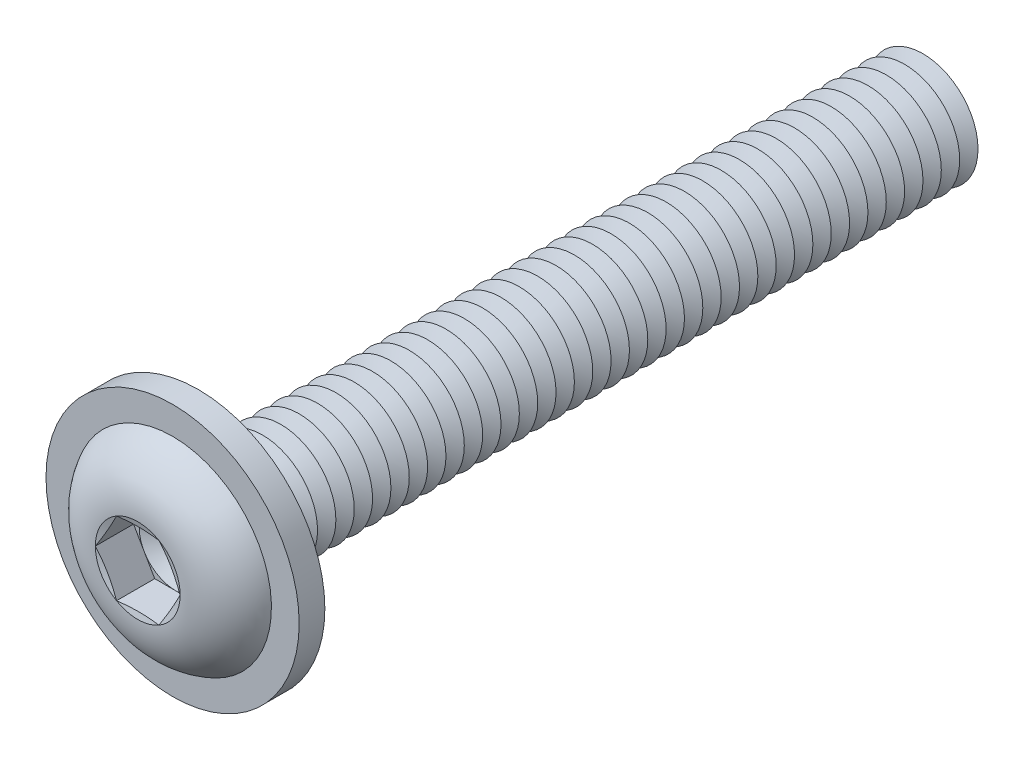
from build123d import *

# Parameters (mm, degrees)
FILLET1_R           = 0.25
LPATTERN1_COUNT     = 40
LPATTERN1_PITCH     = 0.5
CUT_EXTRUDE1_DEPTH  = 1.04
SKETCH5_R           = 3.45
SKETCH5_R_2         = 1.75
BOSS_EXTRUDE1_DEPTH = 0.7


with BuildPart() as part:
    # Sketch1 → Revolve1 (revolve)
    with BuildSketch(Plane(origin=(0, 0, 0), x_dir=(0, 0, -1), z_dir=(1, 0, 0)), mode=Mode.PRIVATE) as revolve1_sk:
        with BuildLine():
            Line((0, 1.5), (0, 2.85))
            ThreePointArc((0, 2.85), (-1.182850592, 2.35063849), (-1.65, 1.1547))
            Line((-1.65, 1.1547), (-1.495299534, 0.57735))
            Line((-1.495299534, 0.57735), (-1.65, 0.57735))
            Line((-1.65, 0.57735), (-1.65, 0))
            Line((-1.65, 0), (20, 0))
            Line((20, 0), (20, 1.5))
            Line((20, 1.5), (0, 1.5))
        make_face()
    revolve(revolve1_sk.sketch.rotate(Axis((0, 0, -20), (0, 0, 1)), 90), axis=Axis((0, 0, -20), (0, 0, 1)))

    # Fillet1
    fillet1_edges = [part.edges().sort_by_distance(p)[0] for p in [
        (1.5, 0, 0),
    ]]
    fillet(fillet1_edges, radius=FILLET1_R)

    # Sketch2 → Cut-Revolve1 (revolve, cut)
    with BuildSketch(Plane(origin=(0, 0, 0), x_dir=(0, 0, -1), z_dir=(1, 0, 0)), mode=Mode.PRIVATE) as cut_revolve1_sk:
        Polygon((19.75, 1.5), (20.25, 1.5), (20, 1.066987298), align=None)
    cut_revolve1 = revolve(cut_revolve1_sk.sketch.rotate(Axis((0, 0, -20), (0, 0, -1)), 270), axis=Axis((0, 0, -20), (0, 0, -1)), mode=Mode.SUBTRACT)

    # LPattern1: Cut-Revolve1 ×40
    with Locations(*[(0, 0, i * LPATTERN1_PITCH) for i in range(1, LPATTERN1_COUNT)]):
        add(cut_revolve1, mode=Mode.SUBTRACT)

    # Sketch3 → Cut-Extrude1 (cut)
    with BuildSketch(Plane.XY.offset(1.65)):
        Polygon((0.57735, 0.999999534), (-0.57735, 0.999999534), (-1.1547, 0), (-0.57735, -0.999999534), (0.57735, -0.999999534), (1.1547, 0), align=None)
    extrude(amount=-CUT_EXTRUDE1_DEPTH, mode=Mode.SUBTRACT)

    # Cut-Extrude2 cone 1 section (on through the dimple's axis) → Cut-Extrude2 (revolve, cut)
    with BuildSketch(Plane(origin=(0, 0, 0.61), x_dir=(0, -1, 0), z_dir=(1, 0, 0))):
        Polygon((0, 0), (0.999999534, 0), (0, 0.57735), align=None)
    revolve(axis=Axis((0, 0, 0.61), (0, 0, -1)), mode=Mode.SUBTRACT)

    # Sketch5 → Boss-Extrude1 (add)
    with BuildSketch(Plane(origin=(0, 0, 0), x_dir=(-1, 0, 0), z_dir=(0, 0, -1))):
        with Locations(Location((0, 0, 0), (0, 0, 90))):
            Circle(SKETCH5_R)
        Circle(SKETCH5_R_2, mode=Mode.SUBTRACT)
    extrude(amount=-BOSS_EXTRUDE1_DEPTH)


solid = part.part
